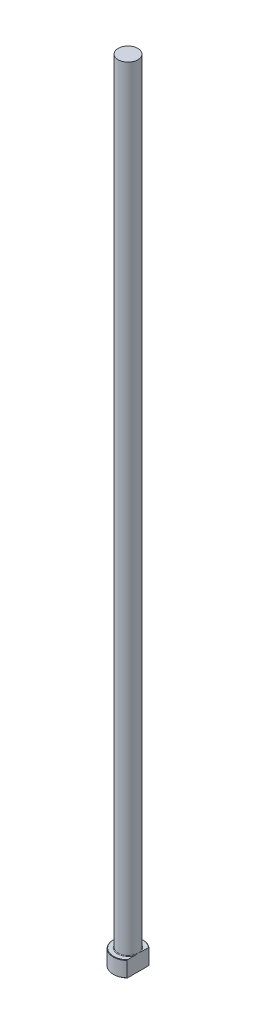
ISO-10303-21;
HEADER;
FILE_DESCRIPTION(('STEP AP214'),'2;1');
FILE_NAME('part.step','',(''),(''),'','','');
FILE_SCHEMA(('AUTOMOTIVE_DESIGN { 1 0 10303 214 1 1 1 1 }'));
ENDSEC;
DATA;
#1=APPLICATION_CONTEXT('core data for automotive mechanical design processes');
#2=APPLICATION_PROTOCOL_DEFINITION('international standard','automotive_design',2000,#1);
#3=PRODUCT_CONTEXT('',#1,'mechanical');
#4=PRODUCT('Part','Part','',(#3));
#5=PRODUCT_RELATED_PRODUCT_CATEGORY('part','',(#4));
#6=PRODUCT_DEFINITION_FORMATION('','',#4);
#7=PRODUCT_DEFINITION_CONTEXT('part definition',#1,'design');
#8=PRODUCT_DEFINITION('design','',#6,#7);
#9=PRODUCT_DEFINITION_SHAPE('','',#8);
#10=(LENGTH_UNIT() NAMED_UNIT(*) SI_UNIT(.MILLI.,.METRE.));
#11=(NAMED_UNIT(*) PLANE_ANGLE_UNIT() SI_UNIT($,.RADIAN.));
#12=(NAMED_UNIT(*) SI_UNIT($,.STERADIAN.) SOLID_ANGLE_UNIT());
#13=UNCERTAINTY_MEASURE_WITH_UNIT(LENGTH_MEASURE(1.E-05),#10,'distance_accuracy_value','');
#14=(GEOMETRIC_REPRESENTATION_CONTEXT(3) GLOBAL_UNCERTAINTY_ASSIGNED_CONTEXT((#13)) GLOBAL_UNIT_ASSIGNED_CONTEXT((#10,
#11,#12)) REPRESENTATION_CONTEXT('',''));
#15=CARTESIAN_POINT('',(0.,0.,0.));
#16=DIRECTION('',(0.,0.,1.));
#17=DIRECTION('',(1.,0.,0.));
#18=AXIS2_PLACEMENT_3D('',#15,#16,#17);
#19=CARTESIAN_POINT('',(0.,0.,0.));
#20=DIRECTION('',(0.,-1.,0.));
#21=DIRECTION('',(0.,0.,-1.));
#22=AXIS2_PLACEMENT_3D('',#19,#20,#21);
#23=PLANE('',#22);
#24=CARTESIAN_POINT('',(0.,0.,0.));
#25=DIRECTION('',(0.,-1.,0.));
#26=DIRECTION('',(0.,0.,-1.));
#27=AXIS2_PLACEMENT_3D('',#24,#25,#26);
#28=CIRCLE('',#27,7.30000000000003);
#29=CARTESIAN_POINT('',(4.99999999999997,0.,5.31883445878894));
#30=VERTEX_POINT('',#29);
#31=CARTESIAN_POINT('',(4.99999999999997,0.,-5.31883445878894));
#32=VERTEX_POINT('',#31);
#33=EDGE_CURVE('E98',#30,#32,#28,.T.);
#34=ORIENTED_EDGE('',*,*,#33,.T.);
#35=DIRECTION('',(0.,0.,1.));
#36=VECTOR('',#35,1.);
#37=CARTESIAN_POINT('',(4.99999999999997,0.,5.59016994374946));
#38=LINE('',#37,#36);
#39=EDGE_CURVE('E83',#32,#30,#38,.T.);
#40=ORIENTED_EDGE('',*,*,#39,.T.);
#41=EDGE_LOOP('',(#34,#40));
#42=FACE_BOUND('',#41,.T.);
#43=ADVANCED_FACE('F32',(#42),#23,.T.);
#44=CARTESIAN_POINT('',(0.,259.958771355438,0.));
#45=DIRECTION('',(0.,1.,0.));
#46=DIRECTION('',(0.,0.,1.));
#47=AXIS2_PLACEMENT_3D('',#44,#45,#46);
#48=CYLINDRICAL_SURFACE('',#47,7.49999999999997);
#49=CARTESIAN_POINT('',(0.,7.80000000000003,0.));
#50=DIRECTION('',(0.,1.,0.));
#51=DIRECTION('',(0.,0.,1.));
#52=AXIS2_PLACEMENT_3D('',#49,#50,#51);
#53=CIRCLE('',#52,7.49999999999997);
#54=CARTESIAN_POINT('',(4.99999999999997,7.80000000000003,5.59016994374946));
#55=VERTEX_POINT('',#54);
#56=CARTESIAN_POINT('',(4.99999999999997,7.80000000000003,-5.59016994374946));
#57=VERTEX_POINT('',#56);
#58=EDGE_CURVE('E104',#55,#57,#53,.F.);
#59=ORIENTED_EDGE('',*,*,#58,.T.);
#60=DIRECTION('',(0.,-1.,0.));
#61=VECTOR('',#60,1.);
#62=CARTESIAN_POINT('',(4.99999999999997,400.,-5.59016994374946));
#63=LINE('',#62,#61);
#64=CARTESIAN_POINT('',(4.99999999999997,0.199999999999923,-5.59016994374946));
#65=VERTEX_POINT('',#64);
#66=EDGE_CURVE('E183',#57,#65,#63,.T.);
#67=ORIENTED_EDGE('',*,*,#66,.T.);
#68=CARTESIAN_POINT('',(0.,0.199999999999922,0.));
#69=DIRECTION('',(0.,-1.,0.));
#70=DIRECTION('',(0.,0.,-1.));
#71=AXIS2_PLACEMENT_3D('',#68,#69,#70);
#72=CIRCLE('',#71,7.49999999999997);
#73=CARTESIAN_POINT('',(4.99999999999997,0.199999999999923,5.59016994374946));
#74=VERTEX_POINT('',#73);
#75=EDGE_CURVE('E100',#65,#74,#72,.F.);
#76=ORIENTED_EDGE('',*,*,#75,.T.);
#77=DIRECTION('',(0.,-1.,0.));
#78=VECTOR('',#77,1.);
#79=CARTESIAN_POINT('',(4.99999999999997,400.,5.59016994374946));
#80=LINE('',#79,#78);
#81=EDGE_CURVE('E93',#55,#74,#80,.T.);
#82=ORIENTED_EDGE('',*,*,#81,.F.);
#83=EDGE_LOOP('',(#59,#67,#76,#82));
#84=FACE_BOUND('',#83,.T.);
#85=ADVANCED_FACE('F158',(#84),#48,.T.);
#86=CARTESIAN_POINT('',(-7.49999999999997,8.,0.));
#87=DIRECTION('',(0.,1.,0.));
#88=DIRECTION('',(0.,0.,1.));
#89=AXIS2_PLACEMENT_3D('',#86,#87,#88);
#90=PLANE('',#89);
#91=CARTESIAN_POINT('',(0.,8.,0.));
#92=DIRECTION('',(0.,1.,0.));
#93=DIRECTION('',(0.,0.,1.));
#94=AXIS2_PLACEMENT_3D('',#91,#92,#93);
#95=CIRCLE('',#94,7.29999999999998);
#96=CARTESIAN_POINT('',(4.99999999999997,8.,-5.31883445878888));
#97=VERTEX_POINT('',#96);
#98=CARTESIAN_POINT('',(4.99999999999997,8.,5.31883445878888));
#99=VERTEX_POINT('',#98);
#100=EDGE_CURVE('E178',#97,#99,#95,.T.);
#101=ORIENTED_EDGE('',*,*,#100,.T.);
#102=DIRECTION('',(0.,0.,-1.));
#103=VECTOR('',#102,1.);
#104=CARTESIAN_POINT('',(4.99999999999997,8.,0.));
#105=LINE('',#104,#103);
#106=CARTESIAN_POINT('',(4.99999999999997,7.99999999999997,1.75783958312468));
#107=VERTEX_POINT('',#106);
#108=EDGE_CURVE('E57',#99,#107,#105,.T.);
#109=ORIENTED_EDGE('',*,*,#108,.T.);
#110=CARTESIAN_POINT('',(0.,8.,0.));
#111=DIRECTION('',(0.,1.,0.));
#112=DIRECTION('',(0.,0.,1.));
#113=AXIS2_PLACEMENT_3D('',#110,#111,#112);
#114=CIRCLE('',#113,5.29999999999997);
#115=CARTESIAN_POINT('',(4.99999999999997,7.99999999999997,-1.75783958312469));
#116=VERTEX_POINT('',#115);
#117=EDGE_CURVE('E107',#107,#116,#114,.F.);
#118=ORIENTED_EDGE('',*,*,#117,.T.);
#119=EDGE_CURVE('E136',#116,#97,#105,.T.);
#120=ORIENTED_EDGE('',*,*,#119,.T.);
#121=EDGE_LOOP('',(#101,#109,#118,#120));
#122=FACE_BOUND('',#121,.T.);
#123=ADVANCED_FACE('F147',(#122),#90,.T.);
#124=CARTESIAN_POINT('',(0.,8.00000000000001,0.));
#125=DIRECTION('',(0.,-1.,0.));
#126=DIRECTION('',(0.,0.,-1.));
#127=AXIS2_PLACEMENT_3D('',#124,#125,#126);
#128=CONICAL_SURFACE('',#127,7.29999999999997,0.785398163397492);
#129=ORIENTED_EDGE('',*,*,#58,.F.);
#130=CARTESIAN_POINT('',(4.99999999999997,2.02290246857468,12.2996471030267));
#131=CARTESIAN_POINT('',(4.99999999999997,2.19416619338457,12.1147698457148));
#132=CARTESIAN_POINT('',(4.99999999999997,2.36513873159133,11.9296229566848));
#133=CARTESIAN_POINT('',(4.99999999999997,2.70641198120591,11.5587086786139));
#134=CARTESIAN_POINT('',(4.99999999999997,2.87671268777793,11.3729412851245));
#135=CARTESIAN_POINT('',(4.99999999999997,3.38654214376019,10.8145105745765));
#136=CARTESIAN_POINT('',(4.99999999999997,3.72492462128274,10.4407980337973));
#137=CARTESIAN_POINT('',(4.99999999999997,4.39960399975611,9.68746107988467));
#138=CARTESIAN_POINT('',(4.99999999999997,4.73587640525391,9.30781469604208));
#139=CARTESIAN_POINT('',(4.99999999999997,5.40266300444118,8.54355414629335));
#140=CARTESIAN_POINT('',(4.99999999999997,5.73317787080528,8.15894056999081));
#141=CARTESIAN_POINT('',(4.99999999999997,6.32050616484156,7.4605234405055));
#142=CARTESIAN_POINT('',(4.99999999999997,6.57881367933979,7.14797875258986));
#143=CARTESIAN_POINT('',(4.99999999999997,7.08815745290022,6.51684714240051));
#144=CARTESIAN_POINT('',(4.99999999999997,7.33919194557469,6.19825878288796));
#145=CARTESIAN_POINT('',(4.99999999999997,7.70761642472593,5.71446312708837));
#146=CARTESIAN_POINT('',(4.99999999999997,7.82900589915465,5.55230264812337));
#147=CARTESIAN_POINT('',(4.99999999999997,8.06851378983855,5.22558802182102));
#148=CARTESIAN_POINT('',(4.99999999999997,8.18663235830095,5.06103398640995));
#149=CARTESIAN_POINT('',(4.99999999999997,8.41879851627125,4.7291634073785));
#150=CARTESIAN_POINT('',(4.99999999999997,8.53284764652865,4.56184794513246));
#151=CARTESIAN_POINT('',(4.99999999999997,8.75590299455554,4.22389957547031));
#152=CARTESIAN_POINT('',(4.99999999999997,8.8649097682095,4.05326703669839));
#153=CARTESIAN_POINT('',(4.99999999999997,9.07352802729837,3.71301730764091));
#154=CARTESIAN_POINT('',(4.99999999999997,9.1733191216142,3.54351083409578));
#155=CARTESIAN_POINT('',(4.99999999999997,9.36528183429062,3.20017857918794));
#156=CARTESIAN_POINT('',(4.99999999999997,9.45745260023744,3.02635231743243));
#157=CARTESIAN_POINT('',(4.99999999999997,9.63197812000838,2.67392882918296));
#158=CARTESIAN_POINT('',(4.99999999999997,9.71433885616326,2.49533459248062));
#159=CARTESIAN_POINT('',(4.99999999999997,9.86657328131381,2.13287211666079));
#160=CARTESIAN_POINT('',(4.99999999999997,9.93645048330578,1.94900537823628));
#161=CARTESIAN_POINT('',(4.99999999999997,10.0468845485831,1.61681363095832));
#162=CARTESIAN_POINT('',(4.99999999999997,10.090511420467,1.46951511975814));
#163=CARTESIAN_POINT('',(4.99999999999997,10.1664777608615,1.17205123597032));
#164=CARTESIAN_POINT('',(4.99999999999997,10.1988213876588,1.02188694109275));
#165=CARTESIAN_POINT('',(4.99999999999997,10.250636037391,0.719811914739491));
#166=CARTESIAN_POINT('',(4.99999999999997,10.2701475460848,0.567908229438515));
#167=CARTESIAN_POINT('',(4.99999999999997,10.2953955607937,0.262949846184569));
#168=CARTESIAN_POINT('',(4.99999999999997,10.3011328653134,0.109895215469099));
#169=CARTESIAN_POINT('',(4.99999999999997,10.2984919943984,-0.196515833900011));
#170=CARTESIAN_POINT('',(4.99999999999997,10.2900745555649,-0.349871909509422));
#171=CARTESIAN_POINT('',(4.99999999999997,10.2595435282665,-0.655203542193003));
#172=CARTESIAN_POINT('',(4.99999999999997,10.2374288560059,-0.807178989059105));
#173=CARTESIAN_POINT('',(4.99999999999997,10.1805990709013,-1.10921231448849));
#174=CARTESIAN_POINT('',(4.99999999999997,10.1458448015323,-1.25926271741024));
#175=CARTESIAN_POINT('',(4.99999999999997,10.0653312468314,-1.55634789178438));
#176=CARTESIAN_POINT('',(4.99999999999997,10.0195714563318,-1.70338252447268));
#177=CARTESIAN_POINT('',(4.99999999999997,9.91304201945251,-2.0105606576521));
#178=CARTESIAN_POINT('',(4.99999999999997,9.85116243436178,-2.17031597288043));
#179=CARTESIAN_POINT('',(4.99999999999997,9.71797424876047,-2.48585686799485));
#180=CARTESIAN_POINT('',(4.99999999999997,9.64666279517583,-2.64164122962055));
#181=CARTESIAN_POINT('',(4.99999999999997,9.4963085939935,-2.94973647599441));
#182=CARTESIAN_POINT('',(4.99999999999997,9.41725276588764,-3.10204092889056));
#183=CARTESIAN_POINT('',(4.99999999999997,9.25299983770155,-3.40325483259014));
#184=CARTESIAN_POINT('',(4.99999999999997,9.16780351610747,-3.55216471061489));
#185=CARTESIAN_POINT('',(4.99999999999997,8.99132919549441,-3.84886097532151));
#186=CARTESIAN_POINT('',(4.99999999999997,8.89998823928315,-3.99660974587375));
#187=CARTESIAN_POINT('',(4.99999999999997,8.71314517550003,-4.2894450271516));
#188=CARTESIAN_POINT('',(4.99999999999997,8.61764297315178,-4.43453147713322));
#189=CARTESIAN_POINT('',(4.99999999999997,8.32624270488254,-4.86605322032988));
#190=CARTESIAN_POINT('',(4.99999999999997,8.12526518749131,-5.1490561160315));
#191=CARTESIAN_POINT('',(4.99999999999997,7.68947947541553,-5.74150232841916));
#192=CARTESIAN_POINT('',(4.99999999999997,7.45349590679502,-6.05007152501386));
#193=CARTESIAN_POINT('',(4.99999999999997,6.97343103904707,-6.66088013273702));
#194=CARTESIAN_POINT('',(4.99999999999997,6.72934863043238,-6.96311866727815));
#195=CARTESIAN_POINT('',(4.99999999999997,6.23516699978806,-7.56307522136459));
#196=CARTESIAN_POINT('',(4.99999999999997,5.98506253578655,-7.86078890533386));
#197=CARTESIAN_POINT('',(4.99999999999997,5.48054649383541,-8.45254667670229));
#198=CARTESIAN_POINT('',(4.99999999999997,5.22613481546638,-8.74659067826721));
#199=CARTESIAN_POINT('',(4.99999999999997,4.72865534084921,-9.31510244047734));
#200=CARTESIAN_POINT('',(4.99999999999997,4.48576913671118,-9.58972942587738));
#201=CARTESIAN_POINT('',(4.99999999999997,3.99769198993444,-10.1369350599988));
#202=CARTESIAN_POINT('',(4.99999999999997,3.75250100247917,-10.4095136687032));
#203=CARTESIAN_POINT('',(4.99999999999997,3.2607553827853,-10.952472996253));
#204=CARTESIAN_POINT('',(4.99999999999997,3.01420432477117,-11.2228569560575));
#205=CARTESIAN_POINT('',(4.99999999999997,2.51960108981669,-11.7622275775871));
#206=CARTESIAN_POINT('',(4.99999999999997,2.27154897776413,-12.0312142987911));
#207=CARTESIAN_POINT('',(4.99999999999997,2.02290246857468,-12.2996471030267));
#208=B_SPLINE_CURVE_WITH_KNOTS('',3,(#130,#131,#132,#133,#134,#135,#136,#137,#138,#139,#140,
#141,#142,#143,#144,#145,#146,#147,#148,#149,#150,#151,#152,#153,#154,#155,#156,#157,#158,#159,
#160,#161,#162,#163,#164,#165,#166,#167,#168,#169,#170,#171,#172,#173,#174,#175,#176,#177,#178,
#179,#180,#181,#182,#183,#184,#185,#186,#187,#188,#189,#190,#191,#192,#193,#194,#195,#196,#197,
#198,#199,#200,#201,#202,#203,#204,#205,#206,#207),.UNSPECIFIED.,.F.,.F.,(4,2,2,2,2,2,2,2,2,2,2,
2,2,2,2,2,2,2,2,2,2,2,2,2,2,2,2,2,2,2,2,2,2,2,2,2,2,2,4),(0.,0.756040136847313,1.5120857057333,
3.02450144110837,4.54594242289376,6.0672044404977,7.28354986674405,8.50018826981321,
9.10784347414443,9.71547035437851,10.3228646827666,10.9301918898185,11.5201366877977,
12.110147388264,12.6997964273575,13.2892792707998,13.7497741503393,14.2100991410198,
14.6689647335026,15.1278037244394,15.5879175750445,16.0480678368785,16.5096559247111,
16.9712652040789,17.4848523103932,17.9985951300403,18.5132211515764,19.0277820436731,
19.5488073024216,20.0698444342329,21.1108480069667,22.2760591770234,23.4414306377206,
24.6078560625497,25.7743087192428,26.8741673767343,27.9740474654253,29.0717909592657,
30.1694873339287),.UNSPECIFIED.);
#209=EDGE_CURVE('E135',#55,#99,#208,.T.);
#210=ORIENTED_EDGE('',*,*,#209,.T.);
#211=ORIENTED_EDGE('',*,*,#100,.F.);
#212=EDGE_CURVE('E127',#97,#57,#208,.T.);
#213=ORIENTED_EDGE('',*,*,#212,.T.);
#214=EDGE_LOOP('',(#129,#210,#211,#213));
#215=FACE_BOUND('',#214,.T.);
#216=ADVANCED_FACE('F143',(#215),#128,.T.);
#217=CARTESIAN_POINT('',(0.,0.199999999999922,0.));
#218=DIRECTION('',(0.,1.,0.));
#219=DIRECTION('',(0.,0.,1.));
#220=AXIS2_PLACEMENT_3D('',#217,#218,#219);
#221=CONICAL_SURFACE('',#220,7.49999999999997,0.785398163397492);
#222=ORIENTED_EDGE('',*,*,#75,.F.);
#223=CARTESIAN_POINT('',(4.99999999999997,5.97709753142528,-12.2996471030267));
#224=CARTESIAN_POINT('',(4.99999999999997,5.80583380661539,-12.1147698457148));
#225=CARTESIAN_POINT('',(4.99999999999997,5.63486126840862,-11.9296229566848));
#226=CARTESIAN_POINT('',(4.99999999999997,5.29358801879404,-11.5587086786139));
#227=CARTESIAN_POINT('',(4.99999999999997,5.12328731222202,-11.3729412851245));
#228=CARTESIAN_POINT('',(4.99999999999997,4.61345785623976,-10.8145105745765));
#229=CARTESIAN_POINT('',(4.99999999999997,4.27507537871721,-10.4407980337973));
#230=CARTESIAN_POINT('',(4.99999999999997,3.60039600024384,-9.68746107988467));
#231=CARTESIAN_POINT('',(4.99999999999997,3.26412359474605,-9.30781469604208));
#232=CARTESIAN_POINT('',(4.99999999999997,2.59733699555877,-8.54355414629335));
#233=CARTESIAN_POINT('',(4.99999999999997,2.26682212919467,-8.15894056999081));
#234=CARTESIAN_POINT('',(4.99999999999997,1.67949383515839,-7.4605234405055));
#235=CARTESIAN_POINT('',(4.99999999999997,1.42118632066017,-7.14797875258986));
#236=CARTESIAN_POINT('',(4.99999999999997,0.911842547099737,-6.51684714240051));
#237=CARTESIAN_POINT('',(4.99999999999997,0.660808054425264,-6.19825878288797));
#238=CARTESIAN_POINT('',(4.99999999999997,0.29238357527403,-5.71446312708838));
#239=CARTESIAN_POINT('',(4.99999999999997,0.170994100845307,-5.55230264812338));
#240=CARTESIAN_POINT('',(4.99999999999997,-0.0685137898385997,-5.22558802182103));
#241=CARTESIAN_POINT('',(4.99999999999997,-0.186632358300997,-5.06103398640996));
#242=CARTESIAN_POINT('',(4.99999999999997,-0.418798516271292,-4.72916340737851));
#243=CARTESIAN_POINT('',(4.99999999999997,-0.532847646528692,-4.56184794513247));
#244=CARTESIAN_POINT('',(4.99999999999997,-0.755902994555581,-4.22389957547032));
#245=CARTESIAN_POINT('',(4.99999999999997,-0.864909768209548,-4.0532670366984));
#246=CARTESIAN_POINT('',(4.99999999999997,-1.07352802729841,-3.71301730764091));
#247=CARTESIAN_POINT('',(4.99999999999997,-1.17331912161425,-3.54351083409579));
#248=CARTESIAN_POINT('',(4.99999999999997,-1.36528183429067,-3.20017857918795));
#249=CARTESIAN_POINT('',(4.99999999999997,-1.45745260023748,-3.02635231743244));
#250=CARTESIAN_POINT('',(4.99999999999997,-1.63197812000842,-2.67392882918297));
#251=CARTESIAN_POINT('',(4.99999999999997,-1.71433885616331,-2.49533459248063));
#252=CARTESIAN_POINT('',(4.99999999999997,-1.86657328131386,-2.1328721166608));
#253=CARTESIAN_POINT('',(4.99999999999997,-1.93645048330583,-1.94900537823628));
#254=CARTESIAN_POINT('',(4.99999999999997,-2.04688454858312,-1.61681363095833));
#255=CARTESIAN_POINT('',(4.99999999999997,-2.09051142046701,-1.46951511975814));
#256=CARTESIAN_POINT('',(4.99999999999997,-2.16647776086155,-1.17205123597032));
#257=CARTESIAN_POINT('',(4.99999999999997,-2.19882138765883,-1.02188694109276));
#258=CARTESIAN_POINT('',(4.99999999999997,-2.25063603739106,-0.719811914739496));
#259=CARTESIAN_POINT('',(4.99999999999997,-2.27014754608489,-0.567908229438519));
#260=CARTESIAN_POINT('',(4.99999999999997,-2.29539556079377,-0.262949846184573));
#261=CARTESIAN_POINT('',(4.99999999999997,-2.3011328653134,-0.109895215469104));
#262=CARTESIAN_POINT('',(4.99999999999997,-2.29849199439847,0.196515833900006));
#263=CARTESIAN_POINT('',(4.99999999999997,-2.29007455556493,0.349871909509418));
#264=CARTESIAN_POINT('',(4.99999999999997,-2.25954352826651,0.655203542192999));
#265=CARTESIAN_POINT('',(4.99999999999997,-2.23742885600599,0.8071789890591));
#266=CARTESIAN_POINT('',(4.99999999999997,-2.18059907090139,1.10921231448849));
#267=CARTESIAN_POINT('',(4.99999999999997,-2.14584480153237,1.25926271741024));
#268=CARTESIAN_POINT('',(4.99999999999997,-2.06533124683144,1.55634789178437));
#269=CARTESIAN_POINT('',(4.99999999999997,-2.01957145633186,1.70338252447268));
#270=CARTESIAN_POINT('',(4.99999999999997,-1.91304201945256,2.01056065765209));
#271=CARTESIAN_POINT('',(4.99999999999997,-1.85116243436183,2.17031597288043));
#272=CARTESIAN_POINT('',(4.99999999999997,-1.71797424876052,2.48585686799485));
#273=CARTESIAN_POINT('',(4.99999999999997,-1.64666279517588,2.64164122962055));
#274=CARTESIAN_POINT('',(4.99999999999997,-1.49630859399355,2.9497364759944));
#275=CARTESIAN_POINT('',(4.99999999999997,-1.41725276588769,3.10204092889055));
#276=CARTESIAN_POINT('',(4.99999999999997,-1.25299983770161,3.40325483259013));
#277=CARTESIAN_POINT('',(4.99999999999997,-1.16780351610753,3.55216471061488));
#278=CARTESIAN_POINT('',(4.99999999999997,-0.99132919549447,3.8488609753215));
#279=CARTESIAN_POINT('',(4.99999999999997,-0.899988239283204,3.99660974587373));
#280=CARTESIAN_POINT('',(4.99999999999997,-0.71314517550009,4.28944502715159));
#281=CARTESIAN_POINT('',(4.99999999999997,-0.617642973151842,4.43453147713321));
#282=CARTESIAN_POINT('',(4.99999999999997,-0.326242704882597,4.86605322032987));
#283=CARTESIAN_POINT('',(4.99999999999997,-0.125265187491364,5.14905611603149));
#284=CARTESIAN_POINT('',(4.99999999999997,0.310520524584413,5.74150232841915));
#285=CARTESIAN_POINT('',(4.99999999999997,0.54650409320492,6.05007152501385));
#286=CARTESIAN_POINT('',(4.99999999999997,1.02656896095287,6.66088013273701));
#287=CARTESIAN_POINT('',(4.99999999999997,1.27065136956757,6.96311866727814));
#288=CARTESIAN_POINT('',(4.99999999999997,1.76483300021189,7.56307522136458));
#289=CARTESIAN_POINT('',(4.99999999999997,2.01493746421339,7.86078890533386));
#290=CARTESIAN_POINT('',(4.99999999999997,2.51945350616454,8.45254667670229));
#291=CARTESIAN_POINT('',(4.99999999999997,2.77386518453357,8.74659067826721));
#292=CARTESIAN_POINT('',(4.99999999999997,3.27134465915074,9.31510244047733));
#293=CARTESIAN_POINT('',(4.99999999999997,3.51423086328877,9.58972942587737));
#294=CARTESIAN_POINT('',(4.99999999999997,4.00230801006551,10.1369350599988));
#295=CARTESIAN_POINT('',(4.99999999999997,4.24749899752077,10.4095136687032));
#296=CARTESIAN_POINT('',(4.99999999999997,4.73924461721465,10.952472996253));
#297=CARTESIAN_POINT('',(4.99999999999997,4.98579567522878,11.2228569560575));
#298=CARTESIAN_POINT('',(4.99999999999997,5.48039891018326,11.762227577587));
#299=CARTESIAN_POINT('',(4.99999999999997,5.72845102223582,12.0312142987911));
#300=CARTESIAN_POINT('',(4.99999999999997,5.97709753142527,12.2996471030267));
#301=B_SPLINE_CURVE_WITH_KNOTS('',3,(#223,#224,#225,#226,#227,#228,#229,#230,#231,#232,#233,
#234,#235,#236,#237,#238,#239,#240,#241,#242,#243,#244,#245,#246,#247,#248,#249,#250,#251,#252,
#253,#254,#255,#256,#257,#258,#259,#260,#261,#262,#263,#264,#265,#266,#267,#268,#269,#270,#271,
#272,#273,#274,#275,#276,#277,#278,#279,#280,#281,#282,#283,#284,#285,#286,#287,#288,#289,#290,
#291,#292,#293,#294,#295,#296,#297,#298,#299,#300),.UNSPECIFIED.,.F.,.F.,(4,2,2,2,2,2,2,2,2,2,2,
2,2,2,2,2,2,2,2,2,2,2,2,2,2,2,2,2,2,2,2,2,2,2,2,2,2,2,4),(0.,0.756040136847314,1.5120857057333,
3.02450144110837,4.54594242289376,6.0672044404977,7.28354986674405,8.50018826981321,
9.10784347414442,9.7154703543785,10.3228646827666,10.9301918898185,11.5201366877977,
12.110147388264,12.6997964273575,13.2892792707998,13.7497741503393,14.2100991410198,
14.6689647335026,15.1278037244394,15.5879175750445,16.0480678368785,16.5096559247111,
16.9712652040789,17.4848523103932,17.9985951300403,18.5132211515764,19.0277820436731,
19.5488073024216,20.0698444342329,21.1108480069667,22.2760591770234,23.4414306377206,
24.6078560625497,25.7743087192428,26.8741673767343,27.9740474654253,29.0717909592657,
30.1694873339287),.UNSPECIFIED.);
#302=EDGE_CURVE('E86',#65,#32,#301,.T.);
#303=ORIENTED_EDGE('',*,*,#302,.T.);
#304=ORIENTED_EDGE('',*,*,#33,.F.);
#305=EDGE_CURVE('E89',#30,#74,#301,.T.);
#306=ORIENTED_EDGE('',*,*,#305,.T.);
#307=EDGE_LOOP('',(#222,#303,#304,#306));
#308=FACE_BOUND('',#307,.T.);
#309=ADVANCED_FACE('F97',(#308),#221,.T.);
#310=CARTESIAN_POINT('',(0.,8.29999999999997,0.));
#311=DIRECTION('',(0.,1.,0.));
#312=DIRECTION('',(0.,0.,1.));
#313=AXIS2_PLACEMENT_3D('',#310,#311,#312);
#314=TOROIDAL_SURFACE('',#313,5.29999999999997,0.3);
#315=CARTESIAN_POINT('',(4.99999999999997,8.29999999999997,0.));
#316=CARTESIAN_POINT('',(4.99999999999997,8.30000062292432,1.3146948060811E-10));
#317=CARTESIAN_POINT('',(4.99999999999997,8.30000124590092,-2.52759224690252E-07));
#318=CARTESIAN_POINT('',(4.99999999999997,8.30000240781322,-9.47164357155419E-07));
#319=CARTESIAN_POINT('',(4.99999999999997,8.30000293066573,-1.40594039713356E-06));
#320=CARTESIAN_POINT('',(4.99999999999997,8.30000402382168,-2.50637608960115E-06));
#321=CARTESIAN_POINT('',(4.99999999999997,8.30000457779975,-3.16588911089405E-06));
#322=CARTESIAN_POINT('',(4.99999999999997,8.30000556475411,-4.52859968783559E-06));
#323=CARTESIAN_POINT('',(4.99999999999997,8.30000600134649,-5.22939450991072E-06));
#324=CARTESIAN_POINT('',(4.99999999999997,8.30000763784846,-7.96121989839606E-06));
#325=CARTESIAN_POINT('',(4.99999999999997,8.30000875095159,-1.00477409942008E-05));
#326=CARTESIAN_POINT('',(4.99999999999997,8.30001056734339,-1.41660874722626E-05));
#327=CARTESIAN_POINT('',(4.99999999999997,8.30001129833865,-1.61861784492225E-05));
#328=CARTESIAN_POINT('',(4.99999999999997,8.30001439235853,-2.4786574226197E-05));
#329=CARTESIAN_POINT('',(4.99999999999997,8.30001672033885,-3.13830284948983E-05));
#330=CARTESIAN_POINT('',(4.99999999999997,8.30002012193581,-4.3808422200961E-05));
#331=CARTESIAN_POINT('',(4.99999999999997,8.30002133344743,-4.95992740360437E-05));
#332=CARTESIAN_POINT('',(4.99999999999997,8.30003020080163,-9.27862616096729E-05));
#333=CARTESIAN_POINT('',(4.99999999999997,8.30003696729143,-0.000130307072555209));
#334=CARTESIAN_POINT('',(4.99999999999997,8.30006659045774,-0.000278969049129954));
#335=CARTESIAN_POINT('',(4.99999999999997,8.30009481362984,-0.000389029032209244));
#336=CARTESIAN_POINT('',(4.99999999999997,8.30020506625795,-0.000826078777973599));
#337=CARTESIAN_POINT('',(4.99999999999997,8.3002836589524,-0.00115365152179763));
#338=CARTESIAN_POINT('',(4.99999999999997,8.30059919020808,-0.00245925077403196));
#339=CARTESIAN_POINT('',(4.99999999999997,8.30084048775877,-0.00343651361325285));
#340=CARTESIAN_POINT('',(4.99999999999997,8.30184626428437,-0.00752058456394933));
#341=CARTESIAN_POINT('',(4.99999999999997,8.3026052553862,-0.0106283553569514));
#342=CARTESIAN_POINT('',(4.99999999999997,8.30996461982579,-0.0407482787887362));
#343=CARTESIAN_POINT('',(4.99999999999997,8.31658985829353,-0.0677561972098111));
#344=CARTESIAN_POINT('',(4.99999999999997,8.32953319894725,-0.120688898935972));
#345=CARTESIAN_POINT('',(4.99999999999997,8.33585289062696,-0.146613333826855));
#346=CARTESIAN_POINT('',(4.99999999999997,8.34926050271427,-0.201795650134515));
#347=CARTESIAN_POINT('',(4.99999999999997,8.35634306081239,-0.231054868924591));
#348=CARTESIAN_POINT('',(4.99999999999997,8.37050252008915,-0.289917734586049));
#349=CARTESIAN_POINT('',(4.99999999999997,8.3775784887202,-0.319521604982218));
#350=CARTESIAN_POINT('',(4.99999999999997,8.39452602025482,-0.391032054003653));
#351=CARTESIAN_POINT('',(4.99999999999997,8.40434071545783,-0.432952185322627));
#352=CARTESIAN_POINT('',(4.99999999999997,8.42340141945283,-0.515763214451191));
#353=CARTESIAN_POINT('',(4.99999999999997,8.43265559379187,-0.556652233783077));
#354=CARTESIAN_POINT('',(4.99999999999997,8.45710553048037,-0.667075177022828));
#355=CARTESIAN_POINT('',(4.99999999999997,8.47194176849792,-0.736689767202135));
#356=CARTESIAN_POINT('',(4.99999999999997,8.50018229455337,-0.876836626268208));
#357=CARTESIAN_POINT('',(4.99999999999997,8.51357312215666,-0.947371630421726));
#358=CARTESIAN_POINT('',(4.99999999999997,8.53930921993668,-1.09497328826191));
#359=CARTESIAN_POINT('',(4.99999999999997,8.55146217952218,-1.17207432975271));
#360=CARTESIAN_POINT('',(4.99999999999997,8.5723966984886,-1.32672649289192));
#361=CARTESIAN_POINT('',(4.99999999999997,8.58117877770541,-1.4042775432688));
#362=CARTESIAN_POINT('',(4.99999999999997,8.59499725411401,-1.56873827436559));
#363=CARTESIAN_POINT('',(4.99999999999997,8.59948802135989,-1.65570044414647));
#364=CARTESIAN_POINT('',(4.99999999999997,8.60018885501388,-1.78535304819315));
#365=CARTESIAN_POINT('',(4.99999999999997,8.59945214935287,-1.82802575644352));
#366=CARTESIAN_POINT('',(4.99999999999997,8.59559364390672,-1.91325081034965));
#367=CARTESIAN_POINT('',(4.99999999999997,8.59247319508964,-1.95580321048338));
#368=CARTESIAN_POINT('',(4.99999999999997,8.58383242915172,-2.03512365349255));
#369=CARTESIAN_POINT('',(4.99999999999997,8.57867386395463,-2.07192937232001));
#370=CARTESIAN_POINT('',(4.99999999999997,8.56543793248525,-2.14526756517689));
#371=CARTESIAN_POINT('',(4.99999999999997,8.55734203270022,-2.18179676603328));
#372=CARTESIAN_POINT('',(4.99999999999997,8.53718005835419,-2.25427226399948));
#373=CARTESIAN_POINT('',(4.99999999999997,8.52507057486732,-2.29020746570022));
#374=CARTESIAN_POINT('',(4.99999999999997,8.5027092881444,-2.34223029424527));
#375=CARTESIAN_POINT('',(4.99999999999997,8.49457811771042,-2.35922314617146));
#376=CARTESIAN_POINT('',(4.99999999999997,8.47657809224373,-2.39224900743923));
#377=CARTESIAN_POINT('',(4.99999999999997,8.46671281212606,-2.40828390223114));
#378=CARTESIAN_POINT('',(4.99999999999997,8.44695893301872,-2.43579467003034));
#379=CARTESIAN_POINT('',(4.99999999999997,8.4374587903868,-2.44754592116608));
#380=CARTESIAN_POINT('',(4.99999999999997,8.41677914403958,-2.4694647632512));
#381=CARTESIAN_POINT('',(4.99999999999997,8.40560543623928,-2.47963758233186));
#382=CARTESIAN_POINT('',(4.99999999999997,8.38617750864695,-2.49393642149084));
#383=CARTESIAN_POINT('',(4.99999999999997,8.37851643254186,-2.49886271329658));
#384=CARTESIAN_POINT('',(4.99999999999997,8.36252740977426,-2.50749953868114));
#385=CARTESIAN_POINT('',(4.99999999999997,8.35419984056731,-2.51121075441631));
#386=CARTESIAN_POINT('',(4.99999999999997,8.33690648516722,-2.5171294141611));
#387=CARTESIAN_POINT('',(4.99999999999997,8.32793451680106,-2.51931927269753));
#388=CARTESIAN_POINT('',(4.99999999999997,8.30973576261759,-2.52185978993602));
#389=CARTESIAN_POINT('',(4.99999999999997,8.30050931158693,-2.52221275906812));
#390=CARTESIAN_POINT('',(4.99999999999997,8.2834916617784,-2.52112455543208));
#391=CARTESIAN_POINT('',(4.99999999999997,8.27568322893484,-2.51993178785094));
#392=CARTESIAN_POINT('',(4.99999999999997,8.26036860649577,-2.51628294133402));
#393=CARTESIAN_POINT('',(4.99999999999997,8.25286261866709,-2.51382603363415));
#394=CARTESIAN_POINT('',(4.99999999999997,8.2359026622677,-2.50685484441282));
#395=CARTESIAN_POINT('',(4.99999999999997,8.22661875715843,-2.50192984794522));
#396=CARTESIAN_POINT('',(4.99999999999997,8.20895514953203,-2.4906654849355));
#397=CARTESIAN_POINT('',(4.99999999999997,8.20057756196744,-2.48432291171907));
#398=CARTESIAN_POINT('',(4.99999999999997,8.1798700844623,-2.46645212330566));
#399=CARTESIAN_POINT('',(4.99999999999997,8.16824151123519,-2.45411867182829));
#400=CARTESIAN_POINT('',(4.99999999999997,8.1469246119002,-2.42790849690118));
#401=CARTESIAN_POINT('',(4.99999999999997,8.13723987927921,-2.41402898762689));
#402=CARTESIAN_POINT('',(4.99999999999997,8.11080706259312,-2.37143175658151));
#403=CARTESIAN_POINT('',(4.99999999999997,8.09628770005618,-2.34134703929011));
#404=CARTESIAN_POINT('',(4.99999999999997,8.07130349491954,-2.27940731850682));
#405=CARTESIAN_POINT('',(4.99999999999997,8.06087110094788,-2.24754035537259));
#406=CARTESIAN_POINT('',(4.99999999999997,8.03890359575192,-2.16787245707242));
#407=CARTESIAN_POINT('',(4.99999999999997,8.02913523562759,-2.11959065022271));
#408=CARTESIAN_POINT('',(4.99999999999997,8.01416953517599,-2.02224928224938));
#409=CARTESIAN_POINT('',(4.99999999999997,8.00898637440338,-1.97318778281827));
#410=CARTESIAN_POINT('',(4.99999999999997,8.00220823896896,-1.87635767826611));
#411=CARTESIAN_POINT('',(4.99999999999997,8.00050709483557,-1.82859609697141));
#412=CARTESIAN_POINT('',(4.99999999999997,7.99969104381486,-1.73330165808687));
#413=CARTESIAN_POINT('',(4.99999999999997,8.00056327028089,-1.68576884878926));
#414=CARTESIAN_POINT('',(4.99999999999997,8.00484296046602,-1.57937770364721));
#415=CARTESIAN_POINT('',(4.99999999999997,8.00880932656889,-1.52054285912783));
#416=CARTESIAN_POINT('',(4.99999999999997,8.01925964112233,-1.4031297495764));
#417=CARTESIAN_POINT('',(4.99999999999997,8.02574264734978,-1.34455139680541));
#418=CARTESIAN_POINT('',(4.99999999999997,8.0409008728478,-1.22627662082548));
#419=CARTESIAN_POINT('',(4.99999999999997,8.04962425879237,-1.16658647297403));
#420=CARTESIAN_POINT('',(4.99999999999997,8.0687792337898,-1.04732463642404));
#421=CARTESIAN_POINT('',(4.99999999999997,8.0792152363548,-0.987753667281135));
#422=CARTESIAN_POINT('',(4.99999999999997,8.10551698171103,-0.846936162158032));
#423=CARTESIAN_POINT('',(4.99999999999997,8.12196565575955,-0.765799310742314));
#424=CARTESIAN_POINT('',(4.99999999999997,8.15639716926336,-0.604819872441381));
#425=CARTESIAN_POINT('',(4.99999999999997,8.1743605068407,-0.524973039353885));
#426=CARTESIAN_POINT('',(4.99999999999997,8.20921667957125,-0.374726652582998));
#427=CARTESIAN_POINT('',(4.99999999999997,8.22599388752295,-0.304300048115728));
#428=CARTESIAN_POINT('',(4.99999999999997,8.25191105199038,-0.196907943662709));
#429=CARTESIAN_POINT('',(4.99999999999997,8.26090146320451,-0.15990571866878));
#430=CARTESIAN_POINT('',(4.99999999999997,8.27881854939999,-0.0865164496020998));
#431=CARTESIAN_POINT('',(4.99999999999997,8.28774391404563,-0.0501291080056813));
#432=CARTESIAN_POINT('',(4.99999999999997,8.29739627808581,-0.0106218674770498));
#433=CARTESIAN_POINT('',(4.99999999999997,8.29815688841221,-0.00750762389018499));
#434=CARTESIAN_POINT('',(4.99999999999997,8.29916304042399,-0.00342209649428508));
#435=CARTESIAN_POINT('',(4.99999999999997,8.29940309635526,-0.00244985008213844));
#436=CARTESIAN_POINT('',(4.99999999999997,8.29971711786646,-0.00115049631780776));
#437=CARTESIAN_POINT('',(4.99999999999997,8.29979541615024,-0.000824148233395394));
#438=CARTESIAN_POINT('',(4.99999999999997,8.29990531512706,-0.000388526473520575));
#439=CARTESIAN_POINT('',(4.99999999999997,8.29993348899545,-0.000278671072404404));
#440=CARTESIAN_POINT('',(4.99999999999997,8.2999630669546,-0.000130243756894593));
#441=CARTESIAN_POINT('',(4.99999999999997,8.29996982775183,-9.27511380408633E-05));
#442=CARTESIAN_POINT('',(4.99999999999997,8.29997868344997,-4.95929890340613E-05));
#443=CARTESIAN_POINT('',(4.99999999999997,8.29997989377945,-4.38036556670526E-05));
#444=CARTESIAN_POINT('',(4.99999999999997,8.29998329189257,-3.1381418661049E-05));
#445=CARTESIAN_POINT('',(4.99999999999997,8.2999856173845,-2.47865220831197E-05));
#446=CARTESIAN_POINT('',(4.99999999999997,8.29998870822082,-1.61877547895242E-05));
#447=CARTESIAN_POINT('',(4.99999999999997,8.29998943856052,-1.4167776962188E-05));
#448=CARTESIAN_POINT('',(4.99999999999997,8.29999125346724,-1.00495531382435E-05));
#449=CARTESIAN_POINT('',(4.99999999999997,8.29999236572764,-7.96302663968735E-06));
#450=CARTESIAN_POINT('',(4.99999999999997,8.29999400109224,-5.23107421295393E-06));
#451=CARTESIAN_POINT('',(4.99999999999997,8.29999443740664,-4.53021037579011E-06));
#452=CARTESIAN_POINT('',(4.99999999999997,8.29999542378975,-3.16731158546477E-06));
#453=CARTESIAN_POINT('',(4.99999999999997,8.29999597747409,-2.5076772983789E-06));
#454=CARTESIAN_POINT('',(4.99999999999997,8.29999707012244,-1.406958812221E-06));
#455=CARTESIAN_POINT('',(4.99999999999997,8.29999759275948,-9.48032461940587E-07));
#456=CARTESIAN_POINT('',(4.99999999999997,8.29999875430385,-2.53244332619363E-07));
#457=CARTESIAN_POINT('',(4.99999999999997,8.29999937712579,-1.31458893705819E-10));
#458=CARTESIAN_POINT('',(4.99999999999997,8.29999999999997,0.));
#459=B_SPLINE_CURVE_WITH_KNOTS('',3,(#315,#316,#317,#318,#319,#320,#321,#322,#323,#324,#325,
#326,#327,#328,#329,#330,#331,#332,#333,#334,#335,#336,#337,#338,#339,#340,#341,#342,#343,#344,
#345,#346,#347,#348,#349,#350,#351,#352,#353,#354,#355,#356,#357,#358,#359,#360,#361,#362,#363,
#364,#365,#366,#367,#368,#369,#370,#371,#372,#373,#374,#375,#376,#377,#378,#379,#380,#381,#382,
#383,#384,#385,#386,#387,#388,#389,#390,#391,#392,#393,#394,#395,#396,#397,#398,#399,#400,#401,
#402,#403,#404,#405,#406,#407,#408,#409,#410,#411,#412,#413,#414,#415,#416,#417,#418,#419,#420,
#421,#422,#423,#424,#425,#426,#427,#428,#429,#430,#431,#432,#433,#434,#435,#436,#437,#438,#439,
#440,#441,#442,#443,#444,#445,#446,#447,#448,#449,#450,#451,#452,#453,#454,#455,#456,#457,#458),
.UNSPECIFIED.,.T.,.F.,(4,2,2,2,2,2,2,2,2,2,2,2,2,2,2,2,2,2,2,2,2,2,2,2,2,2,2,2,2,2,2,2,2,2,2,2,
2,2,2,2,2,2,2,2,2,2,2,2,2,2,2,2,2,2,2,2,2,2,2,2,2,2,2,2,2,2,2,2,2,2,2,4),(0.,
1.88939299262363E-06,3.98058884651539E-06,6.54818523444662E-06,9.024043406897E-06,
1.60938744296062E-05,2.25328190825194E-05,4.3484391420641E-05,6.12120190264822E-05,
0.000175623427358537,0.000516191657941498,0.00152710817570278,0.00454656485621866,
0.0141443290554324,0.0975679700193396,0.177619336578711,0.267931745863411,0.359245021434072,
0.488405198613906,0.614173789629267,0.827694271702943,1.04305715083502,1.27715608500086,
1.51121890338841,1.77214751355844,1.90013509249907,2.028050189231,2.13945459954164,
2.25157451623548,2.36494894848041,2.42139235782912,2.47772074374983,2.52293802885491,
2.56800219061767,2.59524342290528,2.6224693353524,2.65000494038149,2.67750590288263,
2.70108948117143,2.72468854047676,2.75603978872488,2.78746268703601,2.83802806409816,
2.88868607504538,2.98834295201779,3.08877575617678,3.23618650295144,3.38405153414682,
3.52733651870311,3.66990630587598,3.84673903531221,4.02350562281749,4.20444776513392,
4.38586374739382,4.63419556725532,4.87971270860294,5.09690175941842,5.21113882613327,
5.32353360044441,5.33315137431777,5.33615533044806,5.33716246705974,5.33750240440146,
5.3376167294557,5.33763445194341,5.33765539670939,5.33766183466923,5.33766890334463,
5.33767137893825,5.33767394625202,5.33767603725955,5.3376779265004),.UNSPECIFIED.);
#460=CARTESIAN_POINT('',(4.99999999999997,8.29999999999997,0.));
#461=VERTEX_POINT('',#460);
#462=EDGE_CURVE('E11',#116,#461,#459,.T.);
#463=ORIENTED_EDGE('',*,*,#462,.F.);
#464=ORIENTED_EDGE('',*,*,#117,.F.);
#465=CARTESIAN_POINT('',(4.99999999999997,8.29999999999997,0.));
#466=CARTESIAN_POINT('',(4.99999999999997,8.29999937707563,-1.31469481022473E-10));
#467=CARTESIAN_POINT('',(4.99999999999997,8.29999875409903,2.52759224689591E-07));
#468=CARTESIAN_POINT('',(4.99999999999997,8.29999759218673,9.47164357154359E-07));
#469=CARTESIAN_POINT('',(4.99999999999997,8.29999706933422,1.40594039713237E-06));
#470=CARTESIAN_POINT('',(4.99999999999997,8.29999597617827,2.50637608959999E-06));
#471=CARTESIAN_POINT('',(4.99999999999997,8.29999542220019,3.16588911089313E-06));
#472=CARTESIAN_POINT('',(4.99999999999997,8.29999443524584,4.52859968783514E-06));
#473=CARTESIAN_POINT('',(4.99999999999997,8.29999399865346,5.2293945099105E-06));
#474=CARTESIAN_POINT('',(4.99999999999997,8.29999236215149,7.96121989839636E-06));
#475=CARTESIAN_POINT('',(4.99999999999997,8.29999124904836,1.00477409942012E-05));
#476=CARTESIAN_POINT('',(4.99999999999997,8.29998943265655,1.4166087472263E-05));
#477=CARTESIAN_POINT('',(4.99999999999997,8.29998870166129,1.61861784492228E-05));
#478=CARTESIAN_POINT('',(4.99999999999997,8.29998560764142,2.47865742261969E-05));
#479=CARTESIAN_POINT('',(4.99999999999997,8.2999832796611,3.13830284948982E-05));
#480=CARTESIAN_POINT('',(4.99999999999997,8.29997987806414,4.38084222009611E-05));
#481=CARTESIAN_POINT('',(4.99999999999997,8.29997866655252,4.95992740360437E-05));
#482=CARTESIAN_POINT('',(4.99999999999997,8.29996979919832,9.27862616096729E-05));
#483=CARTESIAN_POINT('',(4.99999999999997,8.29996303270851,0.000130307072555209));
#484=CARTESIAN_POINT('',(4.99999999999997,8.29993340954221,0.000278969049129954));
#485=CARTESIAN_POINT('',(4.99999999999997,8.29990518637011,0.000389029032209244));
#486=CARTESIAN_POINT('',(4.99999999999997,8.299794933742,0.000826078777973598));
#487=CARTESIAN_POINT('',(4.99999999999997,8.29971634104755,0.00115365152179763));
#488=CARTESIAN_POINT('',(4.99999999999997,8.29940080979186,0.00245925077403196));
#489=CARTESIAN_POINT('',(4.99999999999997,8.29915951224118,0.00343651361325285));
#490=CARTESIAN_POINT('',(4.99999999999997,8.29815373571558,0.00752058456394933));
#491=CARTESIAN_POINT('',(4.99999999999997,8.29739474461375,0.0106283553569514));
#492=CARTESIAN_POINT('',(4.99999999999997,8.29003538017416,0.0407482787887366));
#493=CARTESIAN_POINT('',(4.99999999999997,8.28341014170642,0.067756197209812));
#494=CARTESIAN_POINT('',(4.99999999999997,8.2704668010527,0.120688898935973));
#495=CARTESIAN_POINT('',(4.99999999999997,8.26414710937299,0.146613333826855));
#496=CARTESIAN_POINT('',(4.99999999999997,8.25073949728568,0.201795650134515));
#497=CARTESIAN_POINT('',(4.99999999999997,8.24365693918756,0.231054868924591));
#498=CARTESIAN_POINT('',(4.99999999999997,8.2294974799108,0.28991773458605));
#499=CARTESIAN_POINT('',(4.99999999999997,8.22242151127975,0.319521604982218));
#500=CARTESIAN_POINT('',(4.99999999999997,8.20547397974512,0.391032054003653));
#501=CARTESIAN_POINT('',(4.99999999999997,8.19565928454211,0.432952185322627));
#502=CARTESIAN_POINT('',(4.99999999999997,8.17659858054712,0.515763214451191));
#503=CARTESIAN_POINT('',(4.99999999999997,8.16734440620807,0.556652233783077));
#504=CARTESIAN_POINT('',(4.99999999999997,8.14289446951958,0.667075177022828));
#505=CARTESIAN_POINT('',(4.99999999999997,8.12805823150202,0.736689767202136));
#506=CARTESIAN_POINT('',(4.99999999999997,8.09981770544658,0.876836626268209));
#507=CARTESIAN_POINT('',(4.99999999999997,8.08642687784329,0.947371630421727));
#508=CARTESIAN_POINT('',(4.99999999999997,8.06069078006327,1.09497328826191));
#509=CARTESIAN_POINT('',(4.99999999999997,8.04853782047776,1.17207432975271));
#510=CARTESIAN_POINT('',(4.99999999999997,8.02760330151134,1.32672649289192));
#511=CARTESIAN_POINT('',(4.99999999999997,8.01882122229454,1.4042775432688));
#512=CARTESIAN_POINT('',(4.99999999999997,8.00500274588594,1.56873827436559));
#513=CARTESIAN_POINT('',(4.99999999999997,8.00051197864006,1.65570044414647));
#514=CARTESIAN_POINT('',(4.99999999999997,7.99981114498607,1.78535304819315));
#515=CARTESIAN_POINT('',(4.99999999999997,8.00054785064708,1.82802575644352));
#516=CARTESIAN_POINT('',(4.99999999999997,8.00440635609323,1.91325081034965));
#517=CARTESIAN_POINT('',(4.99999999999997,8.00752680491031,1.95580321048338));
#518=CARTESIAN_POINT('',(4.99999999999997,8.01616757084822,2.03512365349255));
#519=CARTESIAN_POINT('',(4.99999999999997,8.02132613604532,2.07192937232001));
#520=CARTESIAN_POINT('',(4.99999999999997,8.03456206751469,2.14526756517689));
#521=CARTESIAN_POINT('',(4.99999999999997,8.04265796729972,2.18179676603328));
#522=CARTESIAN_POINT('',(4.99999999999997,8.06281994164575,2.25427226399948));
#523=CARTESIAN_POINT('',(4.99999999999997,8.07492942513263,2.29020746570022));
#524=CARTESIAN_POINT('',(4.99999999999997,8.09729071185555,2.34223029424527));
#525=CARTESIAN_POINT('',(4.99999999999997,8.10542188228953,2.35922314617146));
#526=CARTESIAN_POINT('',(4.99999999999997,8.12342190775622,2.39224900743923));
#527=CARTESIAN_POINT('',(4.99999999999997,8.13328718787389,2.40828390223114));
#528=CARTESIAN_POINT('',(4.99999999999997,8.15304106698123,2.43579467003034));
#529=CARTESIAN_POINT('',(4.99999999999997,8.16254120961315,2.44754592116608));
#530=CARTESIAN_POINT('',(4.99999999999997,8.18322085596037,2.4694647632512));
#531=CARTESIAN_POINT('',(4.99999999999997,8.19439456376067,2.47963758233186));
#532=CARTESIAN_POINT('',(4.99999999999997,8.213822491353,2.49393642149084));
#533=CARTESIAN_POINT('',(4.99999999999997,8.22148356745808,2.49886271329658));
#534=CARTESIAN_POINT('',(4.99999999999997,8.23747259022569,2.50749953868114));
#535=CARTESIAN_POINT('',(4.99999999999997,8.24580015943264,2.51121075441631));
#536=CARTESIAN_POINT('',(4.99999999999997,8.26309351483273,2.5171294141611));
#537=CARTESIAN_POINT('',(4.99999999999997,8.27206548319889,2.51931927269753));
#538=CARTESIAN_POINT('',(4.99999999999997,8.29026423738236,2.52185978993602));
#539=CARTESIAN_POINT('',(4.99999999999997,8.29949068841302,2.52221275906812));
#540=CARTESIAN_POINT('',(4.99999999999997,8.31650833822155,2.52112455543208));
#541=CARTESIAN_POINT('',(4.99999999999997,8.32431677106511,2.51993178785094));
#542=CARTESIAN_POINT('',(4.99999999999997,8.33963139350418,2.51628294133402));
#543=CARTESIAN_POINT('',(4.99999999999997,8.34713738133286,2.51382603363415));
#544=CARTESIAN_POINT('',(4.99999999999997,8.36409733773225,2.50685484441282));
#545=CARTESIAN_POINT('',(4.99999999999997,8.37338124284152,2.50192984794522));
#546=CARTESIAN_POINT('',(4.99999999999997,8.39104485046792,2.4906654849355));
#547=CARTESIAN_POINT('',(4.99999999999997,8.39942243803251,2.48432291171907));
#548=CARTESIAN_POINT('',(4.99999999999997,8.42012991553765,2.46645212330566));
#549=CARTESIAN_POINT('',(4.99999999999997,8.43175848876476,2.45411867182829));
#550=CARTESIAN_POINT('',(4.99999999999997,8.45307538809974,2.42790849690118));
#551=CARTESIAN_POINT('',(4.99999999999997,8.46276012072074,2.41402898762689));
#552=CARTESIAN_POINT('',(4.99999999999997,8.48919293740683,2.37143175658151));
#553=CARTESIAN_POINT('',(4.99999999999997,8.50371229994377,2.34134703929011));
#554=CARTESIAN_POINT('',(4.99999999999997,8.52869650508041,2.27940731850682));
#555=CARTESIAN_POINT('',(4.99999999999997,8.53912889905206,2.24754035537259));
#556=CARTESIAN_POINT('',(4.99999999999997,8.56109640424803,2.16787245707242));
#557=CARTESIAN_POINT('',(4.99999999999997,8.57086476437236,2.11959065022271));
#558=CARTESIAN_POINT('',(4.99999999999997,8.58583046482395,2.02224928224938));
#559=CARTESIAN_POINT('',(4.99999999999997,8.59101362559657,1.97318778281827));
#560=CARTESIAN_POINT('',(4.99999999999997,8.59779176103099,1.87635767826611));
#561=CARTESIAN_POINT('',(4.99999999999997,8.59949290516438,1.82859609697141));
#562=CARTESIAN_POINT('',(4.99999999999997,8.60030895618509,1.73330165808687));
#563=CARTESIAN_POINT('',(4.99999999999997,8.59943672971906,1.68576884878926));
#564=CARTESIAN_POINT('',(4.99999999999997,8.59515703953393,1.57937770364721));
#565=CARTESIAN_POINT('',(4.99999999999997,8.59119067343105,1.52054285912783));
#566=CARTESIAN_POINT('',(4.99999999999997,8.58074035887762,1.4031297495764));
#567=CARTESIAN_POINT('',(4.99999999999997,8.57425735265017,1.34455139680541));
#568=CARTESIAN_POINT('',(4.99999999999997,8.55909912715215,1.22627662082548));
#569=CARTESIAN_POINT('',(4.99999999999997,8.55037574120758,1.16658647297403));
#570=CARTESIAN_POINT('',(4.99999999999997,8.53122076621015,1.04732463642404));
#571=CARTESIAN_POINT('',(4.99999999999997,8.52078476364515,0.987753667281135));
#572=CARTESIAN_POINT('',(4.99999999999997,8.49448301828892,0.846936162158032));
#573=CARTESIAN_POINT('',(4.99999999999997,8.4780343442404,0.765799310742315));
#574=CARTESIAN_POINT('',(4.99999999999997,8.44360283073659,0.604819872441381));
#575=CARTESIAN_POINT('',(4.99999999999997,8.42563949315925,0.524973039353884));
#576=CARTESIAN_POINT('',(4.99999999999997,8.39078332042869,0.374726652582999));
#577=CARTESIAN_POINT('',(4.99999999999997,8.37400611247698,0.304300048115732));
#578=CARTESIAN_POINT('',(4.99999999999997,8.34808894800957,0.196907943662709));
#579=CARTESIAN_POINT('',(4.99999999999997,8.33909853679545,0.159905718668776));
#580=CARTESIAN_POINT('',(4.99999999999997,8.32118145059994,0.0865164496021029));
#581=CARTESIAN_POINT('',(4.99999999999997,8.31225608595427,0.0501291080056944));
#582=CARTESIAN_POINT('',(4.99999999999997,8.30260372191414,0.0106218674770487));
#583=CARTESIAN_POINT('',(4.99999999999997,8.30184311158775,0.00750762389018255));
#584=CARTESIAN_POINT('',(4.99999999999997,8.30083695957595,0.00342209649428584));
#585=CARTESIAN_POINT('',(4.99999999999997,8.30059690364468,0.00244985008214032));
#586=CARTESIAN_POINT('',(4.99999999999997,8.30028288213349,0.00115049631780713));
#587=CARTESIAN_POINT('',(4.99999999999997,8.30020458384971,0.000824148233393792));
#588=CARTESIAN_POINT('',(4.99999999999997,8.30009468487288,0.000388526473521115));
#589=CARTESIAN_POINT('',(4.99999999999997,8.30006651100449,0.000278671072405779));
#590=CARTESIAN_POINT('',(4.99999999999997,8.30003693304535,0.000130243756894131));
#591=CARTESIAN_POINT('',(4.99999999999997,8.30003017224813,9.27511380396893E-05));
#592=CARTESIAN_POINT('',(4.99999999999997,8.30002131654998,4.95929890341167E-05));
#593=CARTESIAN_POINT('',(4.99999999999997,8.3000201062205,4.38036556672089E-05));
#594=CARTESIAN_POINT('',(4.99999999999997,8.30001670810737,3.13814186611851E-05));
#595=CARTESIAN_POINT('',(4.99999999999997,8.30001438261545,2.47865220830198E-05));
#596=CARTESIAN_POINT('',(4.99999999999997,8.30001129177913,1.61877547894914E-05));
#597=CARTESIAN_POINT('',(4.99999999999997,8.30001056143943,1.41677769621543E-05));
#598=CARTESIAN_POINT('',(4.99999999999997,8.30000874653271,1.00495531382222E-05));
#599=CARTESIAN_POINT('',(4.99999999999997,8.30000763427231,7.96302663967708E-06));
#600=CARTESIAN_POINT('',(4.99999999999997,8.30000599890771,5.23107421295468E-06));
#601=CARTESIAN_POINT('',(4.99999999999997,8.3000055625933,4.53021037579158E-06));
#602=CARTESIAN_POINT('',(4.99999999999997,8.3000045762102,3.16731158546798E-06));
#603=CARTESIAN_POINT('',(4.99999999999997,8.30000402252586,2.50767729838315E-06));
#604=CARTESIAN_POINT('',(4.99999999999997,8.30000292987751,1.40695881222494E-06));
#605=CARTESIAN_POINT('',(4.99999999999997,8.30000240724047,9.48032461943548E-07));
#606=CARTESIAN_POINT('',(4.99999999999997,8.30000124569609,2.53244332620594E-07));
#607=CARTESIAN_POINT('',(4.99999999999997,8.30000062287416,1.3145889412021E-10));
#608=CARTESIAN_POINT('',(4.99999999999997,8.29999999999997,0.));
#609=B_SPLINE_CURVE_WITH_KNOTS('',3,(#465,#466,#467,#468,#469,#470,#471,#472,#473,#474,#475,
#476,#477,#478,#479,#480,#481,#482,#483,#484,#485,#486,#487,#488,#489,#490,#491,#492,#493,#494,
#495,#496,#497,#498,#499,#500,#501,#502,#503,#504,#505,#506,#507,#508,#509,#510,#511,#512,#513,
#514,#515,#516,#517,#518,#519,#520,#521,#522,#523,#524,#525,#526,#527,#528,#529,#530,#531,#532,
#533,#534,#535,#536,#537,#538,#539,#540,#541,#542,#543,#544,#545,#546,#547,#548,#549,#550,#551,
#552,#553,#554,#555,#556,#557,#558,#559,#560,#561,#562,#563,#564,#565,#566,#567,#568,#569,#570,
#571,#572,#573,#574,#575,#576,#577,#578,#579,#580,#581,#582,#583,#584,#585,#586,#587,#588,#589,
#590,#591,#592,#593,#594,#595,#596,#597,#598,#599,#600,#601,#602,#603,#604,#605,#606,#607,#608),
.UNSPECIFIED.,.T.,.F.,(4,2,2,2,2,2,2,2,2,2,2,2,2,2,2,2,2,2,2,2,2,2,2,2,2,2,2,2,2,2,2,2,2,2,2,2,
2,2,2,2,2,2,2,2,2,2,2,2,2,2,2,2,2,2,2,2,2,2,2,2,2,2,2,2,2,2,2,2,2,2,2,4),(0.,
1.88939299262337E-06,3.98058884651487E-06,6.54818523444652E-06,9.0240434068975E-06,
1.60938744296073E-05,2.25328190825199E-05,4.34843914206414E-05,6.12120190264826E-05,
0.000175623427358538,0.000516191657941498,0.00152710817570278,0.00454656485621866,
0.0141443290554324,0.0975679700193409,0.177619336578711,0.267931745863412,0.359245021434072,
0.488405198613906,0.614173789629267,0.827694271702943,1.04305715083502,1.27715608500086,
1.51121890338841,1.77214751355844,1.90013509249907,2.028050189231,2.13945459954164,
2.25157451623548,2.36494894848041,2.42139235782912,2.47772074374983,2.52293802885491,
2.56800219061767,2.59524342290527,2.6224693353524,2.65000494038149,2.67750590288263,
2.70108948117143,2.72468854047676,2.75603978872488,2.78746268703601,2.83802806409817,
2.88868607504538,2.98834295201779,3.08877575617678,3.23618650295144,3.38405153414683,
3.52733651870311,3.66990630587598,3.84673903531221,4.02350562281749,4.20444776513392,
4.38586374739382,4.63419556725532,4.87971270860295,5.09690175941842,5.21113882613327,
5.32353360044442,5.33315137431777,5.33615533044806,5.33716246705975,5.33750240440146,
5.33761672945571,5.33763445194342,5.33765539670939,5.33766183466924,5.33766890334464,
5.33767137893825,5.33767394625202,5.33767603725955,5.3376779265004),.UNSPECIFIED.);
#610=EDGE_CURVE('E46',#461,#107,#609,.T.);
#611=ORIENTED_EDGE('',*,*,#610,.F.);
#612=CARTESIAN_POINT('',(0.,8.29999999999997,0.));
#613=DIRECTION('',(0.,1.,0.));
#614=DIRECTION('',(0.,0.,1.));
#615=AXIS2_PLACEMENT_3D('',#612,#613,#614);
#616=CIRCLE('',#615,4.99999999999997);
#617=EDGE_CURVE('E103',#461,#461,#616,.T.);
#618=ORIENTED_EDGE('',*,*,#617,.F.);
#619=EDGE_LOOP('',(#463,#464,#611,#618));
#620=FACE_BOUND('',#619,.T.);
#621=ADVANCED_FACE('F34',(#620),#314,.F.);
#622=CARTESIAN_POINT('',(0.,259.958771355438,0.));
#623=DIRECTION('',(0.,1.,0.));
#624=DIRECTION('',(0.,0.,1.));
#625=AXIS2_PLACEMENT_3D('',#622,#623,#624);
#626=CYLINDRICAL_SURFACE('',#625,4.99999999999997);
#627=ORIENTED_EDGE('',*,*,#617,.T.);
#628=EDGE_LOOP('',(#627));
#629=FACE_BOUND('',#628,.T.);
#630=CARTESIAN_POINT('',(0.,400.,0.));
#631=DIRECTION('',(0.,1.,0.));
#632=DIRECTION('',(0.,0.,1.));
#633=AXIS2_PLACEMENT_3D('',#630,#631,#632);
#634=CIRCLE('',#633,4.99999999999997);
#635=CARTESIAN_POINT('',(0.,400.,4.99999999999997));
#636=VERTEX_POINT('',#635);
#637=EDGE_CURVE('E101',#636,#636,#634,.T.);
#638=ORIENTED_EDGE('',*,*,#637,.F.);
#639=EDGE_LOOP('',(#638));
#640=FACE_BOUND('',#639,.T.);
#641=ADVANCED_FACE('F155',(#629,#640),#626,.T.);
#642=CARTESIAN_POINT('',(-4.99999999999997,400.,0.));
#643=DIRECTION('',(0.,1.,0.));
#644=DIRECTION('',(0.,0.,1.));
#645=AXIS2_PLACEMENT_3D('',#642,#643,#644);
#646=PLANE('',#645);
#647=ORIENTED_EDGE('',*,*,#637,.T.);
#648=EDGE_LOOP('',(#647));
#649=FACE_BOUND('',#648,.T.);
#650=ADVANCED_FACE('F121',(#649),#646,.T.);
#651=CARTESIAN_POINT('',(4.99999999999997,400.,5.59016994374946));
#652=DIRECTION('',(1.,0.,0.));
#653=DIRECTION('',(0.,0.,-1.));
#654=AXIS2_PLACEMENT_3D('',#651,#652,#653);
#655=PLANE('',#654);
#656=ORIENTED_EDGE('',*,*,#66,.F.);
#657=ORIENTED_EDGE('',*,*,#212,.F.);
#658=ORIENTED_EDGE('',*,*,#119,.F.);
#659=ORIENTED_EDGE('',*,*,#462,.T.);
#660=ORIENTED_EDGE('',*,*,#610,.T.);
#661=ORIENTED_EDGE('',*,*,#108,.F.);
#662=ORIENTED_EDGE('',*,*,#209,.F.);
#663=ORIENTED_EDGE('',*,*,#81,.T.);
#664=ORIENTED_EDGE('',*,*,#305,.F.);
#665=ORIENTED_EDGE('',*,*,#39,.F.);
#666=ORIENTED_EDGE('',*,*,#302,.F.);
#667=EDGE_LOOP('',(#656,#657,#658,#659,#660,#661,#662,#663,#664,#665,#666));
#668=FACE_BOUND('',#667,.T.);
#669=ADVANCED_FACE('F85',(#668),#655,.T.);
#670=CLOSED_SHELL('',(#43,#85,#123,#216,#309,#621,#641,#650,#669));
#671=MANIFOLD_SOLID_BREP('B2',#670);
#672=ADVANCED_BREP_SHAPE_REPRESENTATION('',(#18,#671),#14);
#673=SHAPE_DEFINITION_REPRESENTATION(#9,#672);
ENDSEC;
END-ISO-10303-21;
